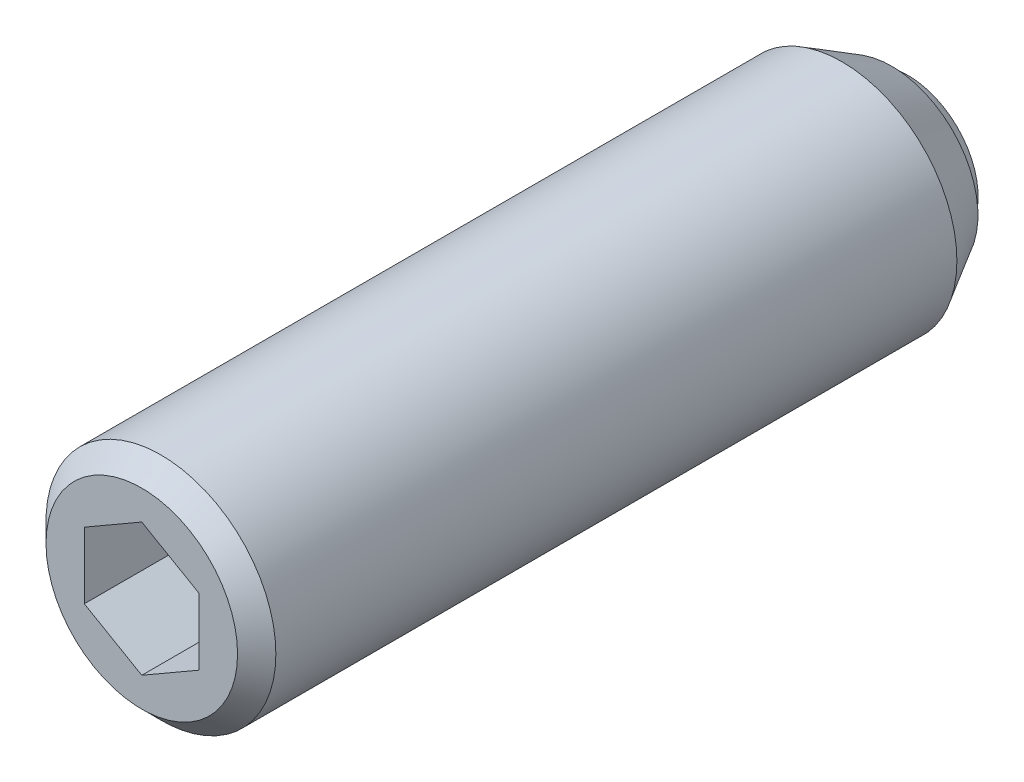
ISO-10303-21;
HEADER;
FILE_DESCRIPTION(('STEP AP214'),'2;1');
FILE_NAME('part.step','',(''),(''),'','','');
FILE_SCHEMA(('AUTOMOTIVE_DESIGN { 1 0 10303 214 1 1 1 1 }'));
ENDSEC;
DATA;
#1=APPLICATION_CONTEXT('core data for automotive mechanical design processes');
#2=APPLICATION_PROTOCOL_DEFINITION('international standard','automotive_design',2000,#1);
#3=PRODUCT_CONTEXT('',#1,'mechanical');
#4=PRODUCT('Part','Part','',(#3));
#5=PRODUCT_RELATED_PRODUCT_CATEGORY('part','',(#4));
#6=PRODUCT_DEFINITION_FORMATION('','',#4);
#7=PRODUCT_DEFINITION_CONTEXT('part definition',#1,'design');
#8=PRODUCT_DEFINITION('design','',#6,#7);
#9=PRODUCT_DEFINITION_SHAPE('','',#8);
#10=(LENGTH_UNIT() NAMED_UNIT(*) SI_UNIT(.MILLI.,.METRE.));
#11=(NAMED_UNIT(*) PLANE_ANGLE_UNIT() SI_UNIT($,.RADIAN.));
#12=(NAMED_UNIT(*) SI_UNIT($,.STERADIAN.) SOLID_ANGLE_UNIT());
#13=UNCERTAINTY_MEASURE_WITH_UNIT(LENGTH_MEASURE(1.E-05),#10,'distance_accuracy_value','');
#14=(GEOMETRIC_REPRESENTATION_CONTEXT(3) GLOBAL_UNCERTAINTY_ASSIGNED_CONTEXT((#13)) GLOBAL_UNIT_ASSIGNED_CONTEXT((#10,
#11,#12)) REPRESENTATION_CONTEXT('',''));
#15=CARTESIAN_POINT('',(0.,0.,0.));
#16=DIRECTION('',(0.,0.,1.));
#17=DIRECTION('',(1.,0.,0.));
#18=AXIS2_PLACEMENT_3D('',#15,#16,#17);
#19=CARTESIAN_POINT('',(3.,1.73205080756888,37.5));
#20=DIRECTION('',(0.5,0.86602540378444,0.));
#21=DIRECTION('',(0.86602540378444,-0.5,0.));
#22=AXIS2_PLACEMENT_3D('',#19,#20,#21);
#23=PLANE('',#22);
#24=DIRECTION('',(0.,0.,1.));
#25=VECTOR('',#24,1.);
#26=CARTESIAN_POINT('',(3.,1.73205080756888,37.5));
#27=LINE('',#26,#25);
#28=CARTESIAN_POINT('',(3.,1.73205080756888,35.));
#29=VERTEX_POINT('',#28);
#30=CARTESIAN_POINT('',(3.,1.73205080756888,40.));
#31=VERTEX_POINT('',#30);
#32=EDGE_CURVE('E68',#29,#31,#27,.T.);
#33=ORIENTED_EDGE('',*,*,#32,.T.);
#34=DIRECTION('',(-0.86602540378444,0.5,0.));
#35=VECTOR('',#34,1.);
#36=CARTESIAN_POINT('',(3.,1.73205080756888,40.));
#37=LINE('',#36,#35);
#38=CARTESIAN_POINT('',(0.,3.46410161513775,40.));
#39=VERTEX_POINT('',#38);
#40=EDGE_CURVE('E29',#31,#39,#37,.T.);
#41=ORIENTED_EDGE('',*,*,#40,.T.);
#42=DIRECTION('',(0.,0.,1.));
#43=VECTOR('',#42,1.);
#44=CARTESIAN_POINT('',(0.,3.46410161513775,37.5));
#45=LINE('',#44,#43);
#46=CARTESIAN_POINT('',(0.,3.46410161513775,35.));
#47=VERTEX_POINT('',#46);
#48=EDGE_CURVE('E80',#47,#39,#45,.T.);
#49=ORIENTED_EDGE('',*,*,#48,.F.);
#50=DIRECTION('',(-0.86602540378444,0.5,0.));
#51=VECTOR('',#50,1.);
#52=CARTESIAN_POINT('',(3.,1.73205080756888,35.));
#53=LINE('',#52,#51);
#54=EDGE_CURVE('E79',#29,#47,#53,.T.);
#55=ORIENTED_EDGE('',*,*,#54,.F.);
#56=EDGE_LOOP('',(#33,#41,#49,#55));
#57=FACE_BOUND('',#56,.T.);
#58=ADVANCED_FACE('F14',(#57),#23,.F.);
#59=CARTESIAN_POINT('',(3.,-1.73205080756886,37.5));
#60=DIRECTION('',(1.,0.,0.));
#61=DIRECTION('',(0.,-1.,0.));
#62=AXIS2_PLACEMENT_3D('',#59,#60,#61);
#63=PLANE('',#62);
#64=DIRECTION('',(0.,0.,1.));
#65=VECTOR('',#64,1.);
#66=CARTESIAN_POINT('',(3.,-1.73205080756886,37.5));
#67=LINE('',#66,#65);
#68=CARTESIAN_POINT('',(3.,-1.73205080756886,35.));
#69=VERTEX_POINT('',#68);
#70=CARTESIAN_POINT('',(3.,-1.73205080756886,40.));
#71=VERTEX_POINT('',#70);
#72=EDGE_CURVE('E76',#69,#71,#67,.T.);
#73=ORIENTED_EDGE('',*,*,#72,.T.);
#74=DIRECTION('',(0.,1.,0.));
#75=VECTOR('',#74,1.);
#76=CARTESIAN_POINT('',(3.,-1.73205080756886,40.));
#77=LINE('',#76,#75);
#78=EDGE_CURVE('E75',#71,#31,#77,.T.);
#79=ORIENTED_EDGE('',*,*,#78,.T.);
#80=ORIENTED_EDGE('',*,*,#32,.F.);
#81=DIRECTION('',(0.,1.,0.));
#82=VECTOR('',#81,1.);
#83=CARTESIAN_POINT('',(3.,-1.73205080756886,35.));
#84=LINE('',#83,#82);
#85=EDGE_CURVE('E72',#69,#29,#84,.T.);
#86=ORIENTED_EDGE('',*,*,#85,.F.);
#87=EDGE_LOOP('',(#73,#79,#80,#86));
#88=FACE_BOUND('',#87,.T.);
#89=ADVANCED_FACE('F70',(#88),#63,.F.);
#90=CARTESIAN_POINT('',(3.,-1.73205080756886,37.5));
#91=DIRECTION('',(-0.5,0.866025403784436,0.));
#92=DIRECTION('',(0.866025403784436,0.5,0.));
#93=AXIS2_PLACEMENT_3D('',#90,#91,#92);
#94=PLANE('',#93);
#95=DIRECTION('',(0.,0.,1.));
#96=VECTOR('',#95,1.);
#97=CARTESIAN_POINT('',(0.,-3.46410161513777,37.5));
#98=LINE('',#97,#96);
#99=CARTESIAN_POINT('',(0.,-3.46410161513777,35.));
#100=VERTEX_POINT('',#99);
#101=CARTESIAN_POINT('',(0.,-3.46410161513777,40.));
#102=VERTEX_POINT('',#101);
#103=EDGE_CURVE('E122',#100,#102,#98,.T.);
#104=ORIENTED_EDGE('',*,*,#103,.T.);
#105=DIRECTION('',(-0.866025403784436,-0.5,0.));
#106=VECTOR('',#105,1.);
#107=CARTESIAN_POINT('',(3.,-1.73205080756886,40.));
#108=LINE('',#107,#106);
#109=EDGE_CURVE('E113',#71,#102,#108,.T.);
#110=ORIENTED_EDGE('',*,*,#109,.F.);
#111=ORIENTED_EDGE('',*,*,#72,.F.);
#112=DIRECTION('',(0.866025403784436,0.5,0.));
#113=VECTOR('',#112,1.);
#114=CARTESIAN_POINT('',(0.,-3.46410161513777,35.));
#115=LINE('',#114,#113);
#116=EDGE_CURVE('E89',#100,#69,#115,.T.);
#117=ORIENTED_EDGE('',*,*,#116,.F.);
#118=EDGE_LOOP('',(#104,#110,#111,#117));
#119=FACE_BOUND('',#118,.T.);
#120=ADVANCED_FACE('F147',(#119),#94,.T.);
#121=CARTESIAN_POINT('',(-3.,-1.73205080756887,37.5));
#122=DIRECTION('',(-0.5,-0.866025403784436,0.));
#123=DIRECTION('',(-0.866025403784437,0.5,0.));
#124=AXIS2_PLACEMENT_3D('',#121,#122,#123);
#125=PLANE('',#124);
#126=DIRECTION('',(0.,0.,1.));
#127=VECTOR('',#126,1.);
#128=CARTESIAN_POINT('',(-3.,-1.73205080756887,37.5));
#129=LINE('',#128,#127);
#130=CARTESIAN_POINT('',(-3.,-1.73205080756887,35.));
#131=VERTEX_POINT('',#130);
#132=CARTESIAN_POINT('',(-3.,-1.73205080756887,40.));
#133=VERTEX_POINT('',#132);
#134=EDGE_CURVE('E120',#131,#133,#129,.T.);
#135=ORIENTED_EDGE('',*,*,#134,.T.);
#136=DIRECTION('',(0.866025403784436,-0.5,0.));
#137=VECTOR('',#136,1.);
#138=CARTESIAN_POINT('',(-3.,-1.73205080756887,40.));
#139=LINE('',#138,#137);
#140=EDGE_CURVE('E111',#133,#102,#139,.T.);
#141=ORIENTED_EDGE('',*,*,#140,.T.);
#142=ORIENTED_EDGE('',*,*,#103,.F.);
#143=DIRECTION('',(0.866025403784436,-0.5,0.));
#144=VECTOR('',#143,1.);
#145=CARTESIAN_POINT('',(-3.,-1.73205080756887,35.));
#146=LINE('',#145,#144);
#147=EDGE_CURVE('E101',#131,#100,#146,.T.);
#148=ORIENTED_EDGE('',*,*,#147,.F.);
#149=EDGE_LOOP('',(#135,#141,#142,#148));
#150=FACE_BOUND('',#149,.T.);
#151=ADVANCED_FACE('F157',(#150),#125,.F.);
#152=CARTESIAN_POINT('',(-3.,-1.73205080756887,37.5));
#153=DIRECTION('',(1.,0.,0.));
#154=DIRECTION('',(0.,-1.,0.));
#155=AXIS2_PLACEMENT_3D('',#152,#153,#154);
#156=PLANE('',#155);
#157=DIRECTION('',(0.,0.,1.));
#158=VECTOR('',#157,1.);
#159=CARTESIAN_POINT('',(-3.,1.73205080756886,37.5));
#160=LINE('',#159,#158);
#161=CARTESIAN_POINT('',(-3.,1.73205080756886,35.));
#162=VERTEX_POINT('',#161);
#163=CARTESIAN_POINT('',(-3.,1.73205080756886,40.));
#164=VERTEX_POINT('',#163);
#165=EDGE_CURVE('E37',#162,#164,#160,.T.);
#166=ORIENTED_EDGE('',*,*,#165,.T.);
#167=DIRECTION('',(0.,1.,0.));
#168=VECTOR('',#167,1.);
#169=CARTESIAN_POINT('',(-3.,-1.73205080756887,40.));
#170=LINE('',#169,#168);
#171=EDGE_CURVE('E108',#133,#164,#170,.T.);
#172=ORIENTED_EDGE('',*,*,#171,.F.);
#173=ORIENTED_EDGE('',*,*,#134,.F.);
#174=DIRECTION('',(0.,-1.,0.));
#175=VECTOR('',#174,1.);
#176=CARTESIAN_POINT('',(-3.,1.73205080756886,35.));
#177=LINE('',#176,#175);
#178=EDGE_CURVE('E98',#162,#131,#177,.T.);
#179=ORIENTED_EDGE('',*,*,#178,.F.);
#180=EDGE_LOOP('',(#166,#172,#173,#179));
#181=FACE_BOUND('',#180,.T.);
#182=ADVANCED_FACE('F153',(#181),#156,.T.);
#183=CARTESIAN_POINT('',(-3.,1.73205080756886,37.5));
#184=DIRECTION('',(0.5,-0.866025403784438,0.));
#185=DIRECTION('',(-0.866025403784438,-0.5,0.));
#186=AXIS2_PLACEMENT_3D('',#183,#184,#185);
#187=PLANE('',#186);
#188=ORIENTED_EDGE('',*,*,#165,.F.);
#189=DIRECTION('',(-0.866025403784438,-0.5,0.));
#190=VECTOR('',#189,1.);
#191=CARTESIAN_POINT('',(0.,3.46410161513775,35.));
#192=LINE('',#191,#190);
#193=EDGE_CURVE('E84',#47,#162,#192,.T.);
#194=ORIENTED_EDGE('',*,*,#193,.F.);
#195=ORIENTED_EDGE('',*,*,#48,.T.);
#196=DIRECTION('',(0.866025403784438,0.5,0.));
#197=VECTOR('',#196,1.);
#198=CARTESIAN_POINT('',(-3.,1.73205080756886,40.));
#199=LINE('',#198,#197);
#200=EDGE_CURVE('E105',#164,#39,#199,.T.);
#201=ORIENTED_EDGE('',*,*,#200,.F.);
#202=EDGE_LOOP('',(#188,#194,#195,#201));
#203=FACE_BOUND('',#202,.T.);
#204=ADVANCED_FACE('F150',(#203),#187,.T.);
#205=CARTESIAN_POINT('',(0.,0.,39.75));
#206=DIRECTION('',(0.,0.,-1.));
#207=DIRECTION('',(1.,0.,0.));
#208=AXIS2_PLACEMENT_3D('',#205,#206,#207);
#209=CYLINDRICAL_SURFACE('',#208,6.);
#210=CARTESIAN_POINT('',(0.,0.,39.));
#211=DIRECTION('',(0.,0.,-1.));
#212=DIRECTION('',(1.,0.,0.));
#213=AXIS2_PLACEMENT_3D('',#210,#211,#212);
#214=CIRCLE('',#213,6.);
#215=CARTESIAN_POINT('',(6.,0.,39.));
#216=VERTEX_POINT('',#215);
#217=EDGE_CURVE('E9',#216,#216,#214,.T.);
#218=ORIENTED_EDGE('',*,*,#217,.T.);
#219=EDGE_LOOP('',(#218));
#220=FACE_BOUND('',#219,.T.);
#221=CARTESIAN_POINT('',(0.,0.,3.44807621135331));
#222=DIRECTION('',(0.,0.,-1.));
#223=DIRECTION('',(-1.,0.,0.));
#224=AXIS2_PLACEMENT_3D('',#221,#222,#223);
#225=CIRCLE('',#224,6.);
#226=CARTESIAN_POINT('',(-6.,0.,3.44807621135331));
#227=VERTEX_POINT('',#226);
#228=EDGE_CURVE('E260',#227,#227,#225,.T.);
#229=ORIENTED_EDGE('',*,*,#228,.F.);
#230=EDGE_LOOP('',(#229));
#231=FACE_BOUND('',#230,.T.);
#232=ADVANCED_FACE('F16',(#220,#231),#209,.T.);
#233=CARTESIAN_POINT('',(0.,0.,39.));
#234=DIRECTION('',(0.,0.,-1.));
#235=DIRECTION('',(1.,0.,0.));
#236=AXIS2_PLACEMENT_3D('',#233,#234,#235);
#237=CONICAL_SURFACE('',#236,6.,0.785398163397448);
#238=CARTESIAN_POINT('',(0.,0.,40.));
#239=DIRECTION('',(0.,0.,-1.));
#240=DIRECTION('',(1.,0.,0.));
#241=AXIS2_PLACEMENT_3D('',#238,#239,#240);
#242=CIRCLE('',#241,5.);
#243=CARTESIAN_POINT('',(5.,0.,40.));
#244=VERTEX_POINT('',#243);
#245=EDGE_CURVE('E22',#244,#244,#242,.T.);
#246=ORIENTED_EDGE('',*,*,#245,.T.);
#247=EDGE_LOOP('',(#246));
#248=FACE_BOUND('',#247,.T.);
#249=ORIENTED_EDGE('',*,*,#217,.F.);
#250=EDGE_LOOP('',(#249));
#251=FACE_BOUND('',#250,.T.);
#252=ADVANCED_FACE('F127',(#248,#251),#237,.T.);
#253=CARTESIAN_POINT('',(0.,0.,40.));
#254=DIRECTION('',(0.,0.,-1.));
#255=DIRECTION('',(1.,0.,0.));
#256=AXIS2_PLACEMENT_3D('',#253,#254,#255);
#257=PLANE('',#256);
#258=ORIENTED_EDGE('',*,*,#200,.T.);
#259=ORIENTED_EDGE('',*,*,#40,.F.);
#260=ORIENTED_EDGE('',*,*,#78,.F.);
#261=ORIENTED_EDGE('',*,*,#109,.T.);
#262=ORIENTED_EDGE('',*,*,#140,.F.);
#263=ORIENTED_EDGE('',*,*,#171,.T.);
#264=EDGE_LOOP('',(#258,#259,#260,#261,#262,#263));
#265=FACE_BOUND('',#264,.T.);
#266=ORIENTED_EDGE('',*,*,#245,.F.);
#267=EDGE_LOOP('',(#266));
#268=FACE_BOUND('',#267,.T.);
#269=ADVANCED_FACE('F130',(#265,#268),#257,.F.);
#270=CARTESIAN_POINT('',(3.,1.73205080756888,35.));
#271=DIRECTION('',(0.,0.,1.));
#272=DIRECTION('',(1.,0.,0.));
#273=AXIS2_PLACEMENT_3D('',#270,#271,#272);
#274=PLANE('',#273);
#275=ORIENTED_EDGE('',*,*,#85,.T.);
#276=ORIENTED_EDGE('',*,*,#54,.T.);
#277=ORIENTED_EDGE('',*,*,#193,.T.);
#278=ORIENTED_EDGE('',*,*,#178,.T.);
#279=ORIENTED_EDGE('',*,*,#147,.T.);
#280=ORIENTED_EDGE('',*,*,#116,.T.);
#281=EDGE_LOOP('',(#275,#276,#277,#278,#279,#280));
#282=FACE_BOUND('',#281,.T.);
#283=ADVANCED_FACE('F86',(#282),#274,.T.);
#284=CARTESIAN_POINT('',(0.,0.,0.));
#285=DIRECTION('',(0.,0.,-1.));
#286=DIRECTION('',(-1.,0.,0.));
#287=AXIS2_PLACEMENT_3D('',#284,#285,#286);
#288=PLANE('',#287);
#289=CARTESIAN_POINT('',(0.,0.,0.));
#290=DIRECTION('',(0.,0.,-1.));
#291=DIRECTION('',(-1.,0.,0.));
#292=AXIS2_PLACEMENT_3D('',#289,#290,#291);
#293=CIRCLE('',#292,3.66060104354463);
#294=CARTESIAN_POINT('',(-3.66060104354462,0.,0.));
#295=VERTEX_POINT('',#294);
#296=EDGE_CURVE('E90',#295,#295,#293,.T.);
#297=ORIENTED_EDGE('',*,*,#296,.T.);
#298=EDGE_LOOP('',(#297));
#299=FACE_BOUND('',#298,.T.);
#300=ADVANCED_FACE('F139',(#299),#288,.T.);
#301=CARTESIAN_POINT('',(0.,0.,2.35));
#302=DIRECTION('',(0.,0.,-1.));
#303=DIRECTION('',(-1.,0.,0.));
#304=AXIS2_PLACEMENT_3D('',#301,#302,#303);
#305=SPHERICAL_SURFACE('',#304,4.35);
#306=CARTESIAN_POINT('',(0.,0.,0.85));
#307=DIRECTION('',(0.,0.,-1.));
#308=DIRECTION('',(-1.,0.,0.));
#309=AXIS2_PLACEMENT_3D('',#306,#307,#308);
#310=CIRCLE('',#309,4.08319727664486);
#311=CARTESIAN_POINT('',(-4.08319727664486,0.,0.85));
#312=VERTEX_POINT('',#311);
#313=EDGE_CURVE('E93',#312,#312,#310,.T.);
#314=CARTESIAN_POINT('',(-4.08319727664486,0.,0.85));
#315=CARTESIAN_POINT('',(-4.07978079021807,0.,0.840699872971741));
#316=CARTESIAN_POINT('',(-4.07633252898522,0.,0.831411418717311));
#317=CARTESIAN_POINT('',(-4.06937262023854,0.,0.812858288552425));
#318=CARTESIAN_POINT('',(-4.06586097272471,0.,0.803593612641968));
#319=CARTESIAN_POINT('',(-4.0587744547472,0.,0.785088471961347));
#320=CARTESIAN_POINT('',(-4.05519958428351,0.,0.775848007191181));
#321=CARTESIAN_POINT('',(-4.04798678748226,0.,0.757391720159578));
#322=CARTESIAN_POINT('',(-4.04434886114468,0.,0.74817589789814));
#323=CARTESIAN_POINT('',(-4.03701012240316,0.,0.729769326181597));
#324=CARTESIAN_POINT('',(-4.03330930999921,0.,0.720578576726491));
#325=CARTESIAN_POINT('',(-4.0258449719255,0.,0.702222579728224));
#326=CARTESIAN_POINT('',(-4.02208144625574,0.,0.693057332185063));
#327=CARTESIAN_POINT('',(-4.01449185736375,0.,0.674752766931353));
#328=CARTESIAN_POINT('',(-4.01066579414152,0.,0.665613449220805));
#329=CARTESIAN_POINT('',(-4.00295130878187,0.,0.647361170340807));
#330=CARTESIAN_POINT('',(-3.99906288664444,0.,0.638248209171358));
#331=CARTESIAN_POINT('',(-3.99122386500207,0.,0.620049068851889));
#332=CARTESIAN_POINT('',(-3.98727326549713,0.,0.610962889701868));
#333=CARTESIAN_POINT('',(-3.9793100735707,0.,0.592817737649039));
#334=CARTESIAN_POINT('',(-3.97529748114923,0.,0.58375876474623));
#335=CARTESIAN_POINT('',(-3.96721049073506,0.,0.565668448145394));
#336=CARTESIAN_POINT('',(-3.96313609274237,0.,0.556637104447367));
#337=CARTESIAN_POINT('',(-3.95492568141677,0.,0.538602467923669));
#338=CARTESIAN_POINT('',(-3.95078966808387,0.,0.529599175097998));
#339=CARTESIAN_POINT('',(-3.94245621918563,0.,0.51162106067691));
#340=CARTESIAN_POINT('',(-3.93825878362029,0.,0.502646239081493));
#341=CARTESIAN_POINT('',(-3.92980268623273,0.,0.484725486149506));
#342=CARTESIAN_POINT('',(-3.9255440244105,0.,0.475779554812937));
#343=CARTESIAN_POINT('',(-3.9169656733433,0.,0.457917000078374));
#344=CARTESIAN_POINT('',(-3.91264598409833,0.,0.44900037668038));
#345=CARTESIAN_POINT('',(-3.90394577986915,0.,0.431196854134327));
#346=CARTESIAN_POINT('',(-3.89956526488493,0.,0.422309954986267));
#347=CARTESIAN_POINT('',(-3.89074361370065,0.,0.404566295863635));
#348=CARTESIAN_POINT('',(-3.88630247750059,0.,0.395709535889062));
#349=CARTESIAN_POINT('',(-3.87735979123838,0.,0.378026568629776));
#350=CARTESIAN_POINT('',(-3.87285824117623,0.,0.369200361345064));
#351=CARTESIAN_POINT('',(-3.8637949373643,0.,0.351578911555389));
#352=CARTESIAN_POINT('',(-3.85923318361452,0.,0.342783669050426));
#353=CARTESIAN_POINT('',(-3.85004968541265,0.,0.325224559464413));
#354=CARTESIAN_POINT('',(-3.84542794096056,0.,0.316460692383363));
#355=CARTESIAN_POINT('',(-3.83612467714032,0.,0.298964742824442));
#356=CARTESIAN_POINT('',(-3.83144315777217,0.,0.290232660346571));
#357=CARTESIAN_POINT('',(-3.82202056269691,0.,0.272800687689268));
#358=CARTESIAN_POINT('',(-3.8172794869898,0.,0.264100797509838));
#359=CARTESIAN_POINT('',(-3.80773800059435,0.,0.246733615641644));
#360=CARTESIAN_POINT('',(-3.80293758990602,0.,0.238066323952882));
#361=CARTESIAN_POINT('',(-3.79327765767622,0.,0.220764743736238));
#362=CARTESIAN_POINT('',(-3.78841813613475,0.,0.212130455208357));
#363=CARTESIAN_POINT('',(-3.77864020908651,0.,0.194895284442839));
#364=CARTESIAN_POINT('',(-3.77372180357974,0.,0.186294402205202));
#365=CARTESIAN_POINT('',(-3.76382633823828,0.,0.169126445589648));
#366=CARTESIAN_POINT('',(-3.75884927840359,0.,0.160559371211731));
#367=CARTESIAN_POINT('',(-3.7488367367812,0.,0.143459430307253));
#368=CARTESIAN_POINT('',(-3.7438012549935,0.,0.134926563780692));
#369=CARTESIAN_POINT('',(-3.73367210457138,0.,0.117895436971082));
#370=CARTESIAN_POINT('',(-3.72857843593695,0.,0.109397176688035));
#371=CARTESIAN_POINT('',(-3.7183331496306,0.,0.0924356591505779));
#372=CARTESIAN_POINT('',(-3.71318153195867,0.,0.0839724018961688));
#373=CARTESIAN_POINT('',(-3.70282058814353,0.,0.0670812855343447));
#374=CARTESIAN_POINT('',(-3.69761126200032,0.,0.0586534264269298));
#375=CARTESIAN_POINT('',(-3.6871351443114,0.,0.0418334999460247));
#376=CARTESIAN_POINT('',(-3.68186835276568,0.,0.0334414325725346));
#377=CARTESIAN_POINT('',(-3.67127755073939,0.,0.0166934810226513));
#378=CARTESIAN_POINT('',(-3.66595354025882,0.,0.00833759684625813));
#379=CARTESIAN_POINT('',(-3.66060104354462,0.,0.));
#380=B_SPLINE_CURVE_WITH_KNOTS('',3,(#314,#315,#316,#317,#318,#319,#320,#321,#322,#323,#324,
#325,#326,#327,#328,#329,#330,#331,#332,#333,#334,#335,#336,#337,#338,#339,#340,#341,#342,#343,
#344,#345,#346,#347,#348,#349,#350,#351,#352,#353,#354,#355,#356,#357,#358,#359,#360,#361,#362,
#363,#364,#365,#366,#367,#368,#369,#370,#371,#372,#373,#374,#375,#376,#377,#378,#379),
.UNSPECIFIED.,.F.,.F.,(4,2,2,2,2,2,2,2,2,2,2,2,2,2,2,2,2,2,2,2,2,2,2,2,2,2,2,2,2,2,2,2,4),(0.,
0.0297233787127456,0.0594467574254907,0.0891701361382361,0.118893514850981,0.148616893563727,
0.178340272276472,0.208063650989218,0.237787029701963,0.267510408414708,0.297233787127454,
0.326957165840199,0.356680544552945,0.38640392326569,0.416127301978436,0.445850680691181,
0.475574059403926,0.505297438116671,0.535020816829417,0.564744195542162,0.594467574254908,
0.624190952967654,0.653914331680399,0.683637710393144,0.71336108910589,0.743084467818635,
0.77280784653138,0.802531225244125,0.832254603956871,0.861977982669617,0.891701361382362,
0.921424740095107,0.951148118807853),.UNSPECIFIED.);
#381=EDGE_CURVE('BSEAM223',#312,#295,#380,.T.);
#382=ORIENTED_EDGE('',*,*,#313,.T.);
#383=ORIENTED_EDGE('',*,*,#296,.F.);
#384=ORIENTED_EDGE('',*,*,#381,.T.);
#385=ORIENTED_EDGE('',*,*,#381,.F.);
#386=EDGE_LOOP('',(#382,#384,#383,#385));
#387=FACE_BOUND('',#386,.T.);
#388=ADVANCED_FACE('F223',(#387),#305,.T.);
#389=CARTESIAN_POINT('',(-4.08319727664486,0.,0.85));
#390=DIRECTION('',(0.,0.,-1.));
#391=DIRECTION('',(-1.,0.,0.));
#392=AXIS2_PLACEMENT_3D('',#389,#390,#391);
#393=PLANE('',#392);
#394=CARTESIAN_POINT('',(0.,0.,0.85));
#395=DIRECTION('',(0.,0.,-1.));
#396=DIRECTION('',(-1.,0.,0.));
#397=AXIS2_PLACEMENT_3D('',#394,#395,#396);
#398=CIRCLE('',#397,4.5);
#399=CARTESIAN_POINT('',(-4.5,0.,0.85));
#400=VERTEX_POINT('',#399);
#401=EDGE_CURVE('E263',#400,#400,#398,.T.);
#402=ORIENTED_EDGE('',*,*,#401,.T.);
#403=EDGE_LOOP('',(#402));
#404=FACE_BOUND('',#403,.T.);
#405=ORIENTED_EDGE('',*,*,#313,.F.);
#406=EDGE_LOOP('',(#405));
#407=FACE_BOUND('',#406,.T.);
#408=ADVANCED_FACE('F232',(#404,#407),#393,.T.);
#409=CARTESIAN_POINT('',(0.,0.,0.85));
#410=DIRECTION('',(0.,0.,1.));
#411=DIRECTION('',(1.,0.,0.));
#412=AXIS2_PLACEMENT_3D('',#409,#410,#411);
#413=CONICAL_SURFACE('',#412,4.5,0.523598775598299);
#414=ORIENTED_EDGE('',*,*,#228,.T.);
#415=EDGE_LOOP('',(#414));
#416=FACE_BOUND('',#415,.T.);
#417=ORIENTED_EDGE('',*,*,#401,.F.);
#418=EDGE_LOOP('',(#417));
#419=FACE_BOUND('',#418,.T.);
#420=ADVANCED_FACE('F242',(#416,#419),#413,.T.);
#421=CLOSED_SHELL('',(#58,#89,#120,#151,#182,#204,#232,#252,#269,#283,#300,#388,#408,#420));
#422=MANIFOLD_SOLID_BREP('B1',#421);
#423=ADVANCED_BREP_SHAPE_REPRESENTATION('',(#18,#422),#14);
#424=SHAPE_DEFINITION_REPRESENTATION(#9,#423);
ENDSEC;
END-ISO-10303-21;
